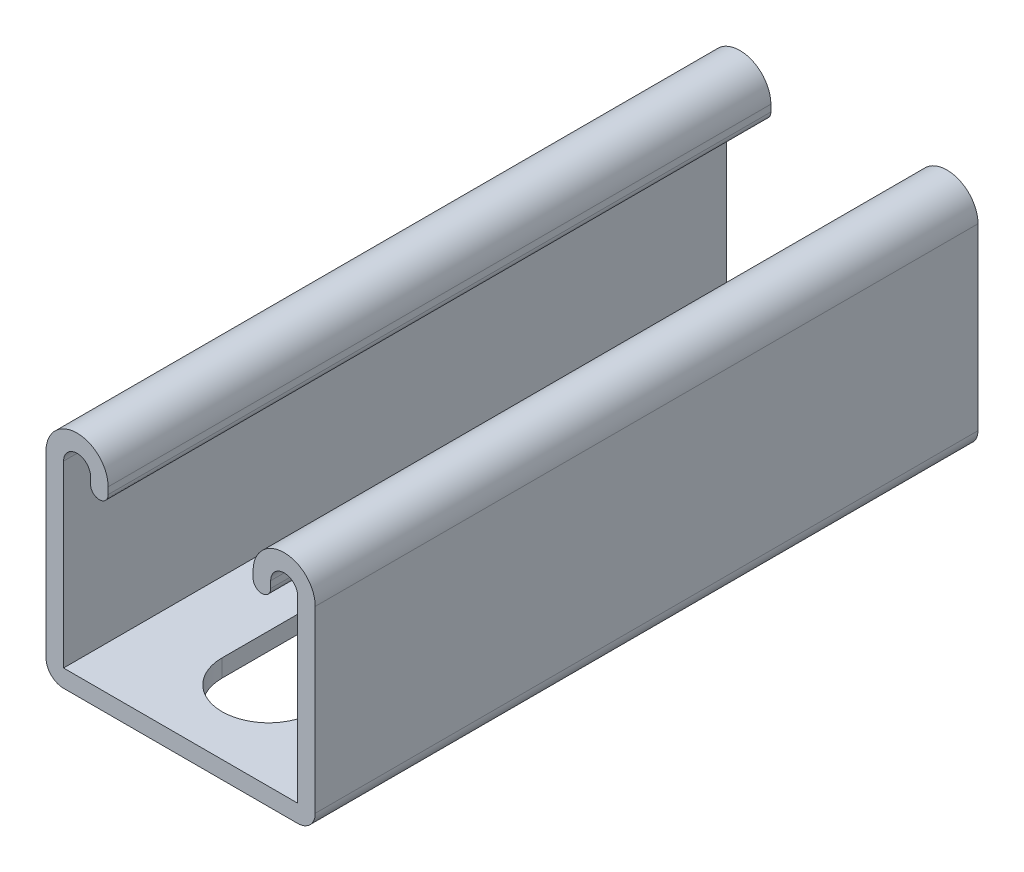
ISO-10303-21;
HEADER;
FILE_DESCRIPTION(('STEP AP214'),'2;1');
FILE_NAME('part.step','',(''),(''),'','','');
FILE_SCHEMA(('AUTOMOTIVE_DESIGN { 1 0 10303 214 1 1 1 1 }'));
ENDSEC;
DATA;
#1=APPLICATION_CONTEXT('core data for automotive mechanical design processes');
#2=APPLICATION_PROTOCOL_DEFINITION('international standard','automotive_design',2000,#1);
#3=PRODUCT_CONTEXT('',#1,'mechanical');
#4=PRODUCT('Part','Part','',(#3));
#5=PRODUCT_RELATED_PRODUCT_CATEGORY('part','',(#4));
#6=PRODUCT_DEFINITION_FORMATION('','',#4);
#7=PRODUCT_DEFINITION_CONTEXT('part definition',#1,'design');
#8=PRODUCT_DEFINITION('design','',#6,#7);
#9=PRODUCT_DEFINITION_SHAPE('','',#8);
#10=(LENGTH_UNIT() NAMED_UNIT(*) SI_UNIT(.MILLI.,.METRE.));
#11=(NAMED_UNIT(*) PLANE_ANGLE_UNIT() SI_UNIT($,.RADIAN.));
#12=(NAMED_UNIT(*) SI_UNIT($,.STERADIAN.) SOLID_ANGLE_UNIT());
#13=UNCERTAINTY_MEASURE_WITH_UNIT(LENGTH_MEASURE(1.E-05),#10,'distance_accuracy_value','');
#14=(GEOMETRIC_REPRESENTATION_CONTEXT(3) GLOBAL_UNCERTAINTY_ASSIGNED_CONTEXT((#13)) GLOBAL_UNIT_ASSIGNED_CONTEXT((#10,
#11,#12)) REPRESENTATION_CONTEXT('',''));
#15=CARTESIAN_POINT('',(0.,0.,0.));
#16=DIRECTION('',(0.,0.,1.));
#17=DIRECTION('',(1.,0.,0.));
#18=AXIS2_PLACEMENT_3D('',#15,#16,#17);
#19=CARTESIAN_POINT('',(-15.875,15.1511,101.6));
#20=DIRECTION('',(0.,0.,-1.));
#21=DIRECTION('',(-1.,0.,0.));
#22=AXIS2_PLACEMENT_3D('',#19,#20,#21);
#23=CYLINDRICAL_SURFACE('',#22,4.7625);
#24=CARTESIAN_POINT('',(-15.875,15.1511,0.));
#25=DIRECTION('',(0.,0.,1.));
#26=DIRECTION('',(-1.,0.,0.));
#27=AXIS2_PLACEMENT_3D('',#24,#25,#26);
#28=CIRCLE('',#27,4.7625);
#29=CARTESIAN_POINT('',(-11.1125,15.1511,0.));
#30=VERTEX_POINT('',#29);
#31=CARTESIAN_POINT('',(-20.6375,15.1511,0.));
#32=VERTEX_POINT('',#31);
#33=EDGE_CURVE('E254',#30,#32,#28,.T.);
#34=ORIENTED_EDGE('',*,*,#33,.T.);
#35=DIRECTION('',(0.,0.,-1.));
#36=VECTOR('',#35,1.);
#37=CARTESIAN_POINT('',(-20.6375,15.1511,101.6));
#38=LINE('',#37,#36);
#39=CARTESIAN_POINT('',(-20.6375,15.1511,101.6));
#40=VERTEX_POINT('',#39);
#41=EDGE_CURVE('E385',#40,#32,#38,.T.);
#42=ORIENTED_EDGE('',*,*,#41,.F.);
#43=CARTESIAN_POINT('',(-15.875,15.1511,101.6));
#44=DIRECTION('',(0.,0.,1.));
#45=DIRECTION('',(-1.,0.,0.));
#46=AXIS2_PLACEMENT_3D('',#43,#44,#45);
#47=CIRCLE('',#46,4.7625);
#48=CARTESIAN_POINT('',(-11.1125,15.1511,101.6));
#49=VERTEX_POINT('',#48);
#50=EDGE_CURVE('E261',#49,#40,#47,.T.);
#51=ORIENTED_EDGE('',*,*,#50,.F.);
#52=DIRECTION('',(0.,0.,-1.));
#53=VECTOR('',#52,1.);
#54=CARTESIAN_POINT('',(-11.1125,15.1511,101.6));
#55=LINE('',#54,#53);
#56=EDGE_CURVE('E299',#49,#30,#55,.T.);
#57=ORIENTED_EDGE('',*,*,#56,.T.);
#58=EDGE_LOOP('',(#34,#42,#51,#57));
#59=FACE_BOUND('',#58,.T.);
#60=ADVANCED_FACE('F33',(#59),#23,.T.);
#61=CARTESIAN_POINT('',(-20.6375,15.1511,101.6));
#62=DIRECTION('',(1.,0.,0.));
#63=DIRECTION('',(0.,1.,0.));
#64=AXIS2_PLACEMENT_3D('',#61,#62,#63);
#65=PLANE('',#64);
#66=DIRECTION('',(0.,-1.,0.));
#67=VECTOR('',#66,1.);
#68=CARTESIAN_POINT('',(-20.6375,15.1511,0.));
#69=LINE('',#68,#67);
#70=CARTESIAN_POINT('',(-20.6375,-12.319,0.));
#71=VERTEX_POINT('',#70);
#72=EDGE_CURVE('E302',#32,#71,#69,.T.);
#73=ORIENTED_EDGE('',*,*,#72,.T.);
#74=DIRECTION('',(0.,0.,-1.));
#75=VECTOR('',#74,1.);
#76=CARTESIAN_POINT('',(-20.6375,-12.319,101.6));
#77=LINE('',#76,#75);
#78=CARTESIAN_POINT('',(-20.6375,-12.319,101.6));
#79=VERTEX_POINT('',#78);
#80=EDGE_CURVE('E382',#79,#71,#77,.T.);
#81=ORIENTED_EDGE('',*,*,#80,.F.);
#82=DIRECTION('',(0.,-1.,0.));
#83=VECTOR('',#82,1.);
#84=CARTESIAN_POINT('',(-20.6375,15.1511,101.6));
#85=LINE('',#84,#83);
#86=EDGE_CURVE('E264',#40,#79,#85,.T.);
#87=ORIENTED_EDGE('',*,*,#86,.F.);
#88=ORIENTED_EDGE('',*,*,#41,.T.);
#89=EDGE_LOOP('',(#73,#81,#87,#88));
#90=FACE_BOUND('',#89,.T.);
#91=ADVANCED_FACE('F426',(#90),#65,.F.);
#92=CARTESIAN_POINT('',(-17.9451,-12.319,101.6));
#93=DIRECTION('',(0.,0.,-1.));
#94=DIRECTION('',(-1.,0.,0.));
#95=AXIS2_PLACEMENT_3D('',#92,#93,#94);
#96=CYLINDRICAL_SURFACE('',#95,2.6924);
#97=CARTESIAN_POINT('',(-17.9451,-12.319,0.));
#98=DIRECTION('',(0.,0.,1.));
#99=DIRECTION('',(-1.,0.,0.));
#100=AXIS2_PLACEMENT_3D('',#97,#98,#99);
#101=CIRCLE('',#100,2.6924);
#102=CARTESIAN_POINT('',(-17.9451,-15.0114,0.));
#103=VERTEX_POINT('',#102);
#104=EDGE_CURVE('E304',#71,#103,#101,.T.);
#105=ORIENTED_EDGE('',*,*,#104,.T.);
#106=DIRECTION('',(0.,0.,-1.));
#107=VECTOR('',#106,1.);
#108=CARTESIAN_POINT('',(-17.9451,-15.0114,101.6));
#109=LINE('',#108,#107);
#110=CARTESIAN_POINT('',(-17.9451,-15.0114,101.6));
#111=VERTEX_POINT('',#110);
#112=EDGE_CURVE('E379',#111,#103,#109,.T.);
#113=ORIENTED_EDGE('',*,*,#112,.F.);
#114=CARTESIAN_POINT('',(-17.9451,-12.319,101.6));
#115=DIRECTION('',(0.,0.,1.));
#116=DIRECTION('',(-1.,0.,0.));
#117=AXIS2_PLACEMENT_3D('',#114,#115,#116);
#118=CIRCLE('',#117,2.6924);
#119=EDGE_CURVE('E267',#79,#111,#118,.T.);
#120=ORIENTED_EDGE('',*,*,#119,.F.);
#121=ORIENTED_EDGE('',*,*,#80,.T.);
#122=EDGE_LOOP('',(#105,#113,#120,#121));
#123=FACE_BOUND('',#122,.T.);
#124=ADVANCED_FACE('F431',(#123),#96,.T.);
#125=CARTESIAN_POINT('',(-17.9451,-15.0114,101.6));
#126=DIRECTION('',(0.,1.,0.));
#127=DIRECTION('',(-1.,0.,0.));
#128=AXIS2_PLACEMENT_3D('',#125,#126,#127);
#129=PLANE('',#128);
#130=DIRECTION('',(0.,0.,-1.));
#131=VECTOR('',#130,1.);
#132=CARTESIAN_POINT('',(-7.14375,-15.0113999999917,73.81875));
#133=LINE('',#132,#131);
#134=CARTESIAN_POINT('',(-7.14375,-15.0114,88.10625));
#135=VERTEX_POINT('',#134);
#136=CARTESIAN_POINT('',(-7.14375,-15.0113999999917,73.81875));
#137=VERTEX_POINT('',#136);
#138=EDGE_CURVE('E207',#135,#137,#133,.T.);
#139=ORIENTED_EDGE('',*,*,#138,.F.);
#140=CARTESIAN_POINT('',(0.,-15.0113999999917,88.10625));
#141=DIRECTION('',(0.,-1.,0.));
#142=DIRECTION('',(1.,0.,0.));
#143=AXIS2_PLACEMENT_3D('',#140,#141,#142);
#144=CIRCLE('',#143,7.14375);
#145=CARTESIAN_POINT('',(7.14375,-15.0113999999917,88.10625));
#146=VERTEX_POINT('',#145);
#147=EDGE_CURVE('E47',#146,#135,#144,.T.);
#148=ORIENTED_EDGE('',*,*,#147,.F.);
#149=DIRECTION('',(0.,0.,1.));
#150=VECTOR('',#149,1.);
#151=CARTESIAN_POINT('',(7.14375,-15.0113999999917,88.10625));
#152=LINE('',#151,#150);
#153=CARTESIAN_POINT('',(7.14375,-15.0113999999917,73.81875));
#154=VERTEX_POINT('',#153);
#155=EDGE_CURVE('E223',#154,#146,#152,.T.);
#156=ORIENTED_EDGE('',*,*,#155,.F.);
#157=CARTESIAN_POINT('',(0.,-15.0113999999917,73.81875));
#158=DIRECTION('',(0.,-1.,0.));
#159=DIRECTION('',(1.,0.,0.));
#160=AXIS2_PLACEMENT_3D('',#157,#158,#159);
#161=CIRCLE('',#160,7.14375);
#162=EDGE_CURVE('E217',#137,#154,#161,.T.);
#163=ORIENTED_EDGE('',*,*,#162,.F.);
#164=EDGE_LOOP('',(#139,#148,#156,#163));
#165=FACE_BOUND('',#164,.T.);
#166=DIRECTION('',(0.,0.,-1.));
#167=VECTOR('',#166,1.);
#168=CARTESIAN_POINT('',(-7.14375,-15.0113999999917,23.01875));
#169=LINE('',#168,#167);
#170=CARTESIAN_POINT('',(-7.14375,-15.0114,37.30625));
#171=VERTEX_POINT('',#170);
#172=CARTESIAN_POINT('',(-7.14375,-15.0113999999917,23.01875));
#173=VERTEX_POINT('',#172);
#174=EDGE_CURVE('E242',#171,#173,#169,.T.);
#175=ORIENTED_EDGE('',*,*,#174,.F.);
#176=CARTESIAN_POINT('',(0.,-15.0113999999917,37.30625));
#177=DIRECTION('',(0.,-1.,0.));
#178=DIRECTION('',(1.,0.,0.));
#179=AXIS2_PLACEMENT_3D('',#176,#177,#178);
#180=CIRCLE('',#179,7.14375);
#181=CARTESIAN_POINT('',(7.14375,-15.0113999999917,37.30625));
#182=VERTEX_POINT('',#181);
#183=EDGE_CURVE('E240',#182,#171,#180,.T.);
#184=ORIENTED_EDGE('',*,*,#183,.F.);
#185=DIRECTION('',(0.,0.,1.));
#186=VECTOR('',#185,1.);
#187=CARTESIAN_POINT('',(7.14375,-15.0113999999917,37.30625));
#188=LINE('',#187,#186);
#189=CARTESIAN_POINT('',(7.14375,-15.0113999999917,23.01875));
#190=VERTEX_POINT('',#189);
#191=EDGE_CURVE('E248',#190,#182,#188,.T.);
#192=ORIENTED_EDGE('',*,*,#191,.F.);
#193=CARTESIAN_POINT('',(0.,-15.0113999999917,23.01875));
#194=DIRECTION('',(0.,-1.,0.));
#195=DIRECTION('',(1.,0.,0.));
#196=AXIS2_PLACEMENT_3D('',#193,#194,#195);
#197=CIRCLE('',#196,7.14375);
#198=EDGE_CURVE('E245',#173,#190,#197,.T.);
#199=ORIENTED_EDGE('',*,*,#198,.F.);
#200=EDGE_LOOP('',(#175,#184,#192,#199));
#201=FACE_BOUND('',#200,.T.);
#202=DIRECTION('',(1.,0.,0.));
#203=VECTOR('',#202,1.);
#204=CARTESIAN_POINT('',(-17.9451,-15.0114,0.));
#205=LINE('',#204,#203);
#206=CARTESIAN_POINT('',(17.9451,-15.0114,0.));
#207=VERTEX_POINT('',#206);
#208=EDGE_CURVE('E306',#103,#207,#205,.T.);
#209=ORIENTED_EDGE('',*,*,#208,.T.);
#210=DIRECTION('',(0.,0.,-1.));
#211=VECTOR('',#210,1.);
#212=CARTESIAN_POINT('',(17.9451,-15.0114,101.6));
#213=LINE('',#212,#211);
#214=CARTESIAN_POINT('',(17.9451,-15.0114,101.6));
#215=VERTEX_POINT('',#214);
#216=EDGE_CURVE('E376',#215,#207,#213,.T.);
#217=ORIENTED_EDGE('',*,*,#216,.F.);
#218=DIRECTION('',(1.,0.,0.));
#219=VECTOR('',#218,1.);
#220=CARTESIAN_POINT('',(-17.9451,-15.0114,101.6));
#221=LINE('',#220,#219);
#222=EDGE_CURVE('E269',#111,#215,#221,.T.);
#223=ORIENTED_EDGE('',*,*,#222,.F.);
#224=ORIENTED_EDGE('',*,*,#112,.T.);
#225=EDGE_LOOP('',(#209,#217,#223,#224));
#226=FACE_BOUND('',#225,.T.);
#227=ADVANCED_FACE('F221',(#165,#201,#226),#129,.F.);
#228=CARTESIAN_POINT('',(17.9451,-12.319,101.6));
#229=DIRECTION('',(0.,0.,-1.));
#230=DIRECTION('',(-1.,0.,0.));
#231=AXIS2_PLACEMENT_3D('',#228,#229,#230);
#232=CYLINDRICAL_SURFACE('',#231,2.6924);
#233=CARTESIAN_POINT('',(17.9451,-12.319,0.));
#234=DIRECTION('',(0.,0.,1.));
#235=DIRECTION('',(1.,0.,0.));
#236=AXIS2_PLACEMENT_3D('',#233,#234,#235);
#237=CIRCLE('',#236,2.6924);
#238=CARTESIAN_POINT('',(20.6375,-12.319,0.));
#239=VERTEX_POINT('',#238);
#240=EDGE_CURVE('E308',#207,#239,#237,.T.);
#241=ORIENTED_EDGE('',*,*,#240,.T.);
#242=DIRECTION('',(0.,0.,-1.));
#243=VECTOR('',#242,1.);
#244=CARTESIAN_POINT('',(20.6375,-12.319,101.6));
#245=LINE('',#244,#243);
#246=CARTESIAN_POINT('',(20.6375,-12.319,101.6));
#247=VERTEX_POINT('',#246);
#248=EDGE_CURVE('E373',#247,#239,#245,.T.);
#249=ORIENTED_EDGE('',*,*,#248,.F.);
#250=CARTESIAN_POINT('',(17.9451,-12.319,101.6));
#251=DIRECTION('',(0.,0.,1.));
#252=DIRECTION('',(1.,0.,0.));
#253=AXIS2_PLACEMENT_3D('',#250,#251,#252);
#254=CIRCLE('',#253,2.6924);
#255=EDGE_CURVE('E271',#215,#247,#254,.T.);
#256=ORIENTED_EDGE('',*,*,#255,.F.);
#257=ORIENTED_EDGE('',*,*,#216,.T.);
#258=EDGE_LOOP('',(#241,#249,#256,#257));
#259=FACE_BOUND('',#258,.T.);
#260=ADVANCED_FACE('F511',(#259),#232,.T.);
#261=CARTESIAN_POINT('',(20.6375,-12.319,101.6));
#262=DIRECTION('',(-1.,0.,0.));
#263=DIRECTION('',(0.,0.,1.));
#264=AXIS2_PLACEMENT_3D('',#261,#262,#263);
#265=PLANE('',#264);
#266=DIRECTION('',(0.,1.,0.));
#267=VECTOR('',#266,1.);
#268=CARTESIAN_POINT('',(20.6375,-12.319,0.));
#269=LINE('',#268,#267);
#270=CARTESIAN_POINT('',(20.6375,15.1511,0.));
#271=VERTEX_POINT('',#270);
#272=EDGE_CURVE('E310',#239,#271,#269,.T.);
#273=ORIENTED_EDGE('',*,*,#272,.T.);
#274=DIRECTION('',(0.,0.,-1.));
#275=VECTOR('',#274,1.);
#276=CARTESIAN_POINT('',(20.6375,15.1511,101.6));
#277=LINE('',#276,#275);
#278=CARTESIAN_POINT('',(20.6375,15.1511,101.6));
#279=VERTEX_POINT('',#278);
#280=EDGE_CURVE('E370',#279,#271,#277,.T.);
#281=ORIENTED_EDGE('',*,*,#280,.F.);
#282=DIRECTION('',(0.,1.,0.));
#283=VECTOR('',#282,1.);
#284=CARTESIAN_POINT('',(20.6375,-12.319,101.6));
#285=LINE('',#284,#283);
#286=EDGE_CURVE('E273',#247,#279,#285,.T.);
#287=ORIENTED_EDGE('',*,*,#286,.F.);
#288=ORIENTED_EDGE('',*,*,#248,.T.);
#289=EDGE_LOOP('',(#273,#281,#287,#288));
#290=FACE_BOUND('',#289,.T.);
#291=ADVANCED_FACE('F507',(#290),#265,.F.);
#292=CARTESIAN_POINT('',(15.875,15.1511,101.6));
#293=DIRECTION('',(0.,0.,-1.));
#294=DIRECTION('',(-1.,0.,0.));
#295=AXIS2_PLACEMENT_3D('',#292,#293,#294);
#296=CYLINDRICAL_SURFACE('',#295,4.7625);
#297=CARTESIAN_POINT('',(15.875,15.1511,0.));
#298=DIRECTION('',(0.,0.,1.));
#299=DIRECTION('',(1.,0.,0.));
#300=AXIS2_PLACEMENT_3D('',#297,#298,#299);
#301=CIRCLE('',#300,4.7625);
#302=CARTESIAN_POINT('',(11.1125,15.1511,0.));
#303=VERTEX_POINT('',#302);
#304=EDGE_CURVE('E312',#271,#303,#301,.T.);
#305=ORIENTED_EDGE('',*,*,#304,.T.);
#306=DIRECTION('',(0.,0.,-1.));
#307=VECTOR('',#306,1.);
#308=CARTESIAN_POINT('',(11.1125,15.1511,101.6));
#309=LINE('',#308,#307);
#310=CARTESIAN_POINT('',(11.1125,15.1511,101.6));
#311=VERTEX_POINT('',#310);
#312=EDGE_CURVE('E367',#311,#303,#309,.T.);
#313=ORIENTED_EDGE('',*,*,#312,.F.);
#314=CARTESIAN_POINT('',(15.875,15.1511,101.6));
#315=DIRECTION('',(0.,0.,1.));
#316=DIRECTION('',(1.,0.,0.));
#317=AXIS2_PLACEMENT_3D('',#314,#315,#316);
#318=CIRCLE('',#317,4.7625);
#319=EDGE_CURVE('E275',#279,#311,#318,.T.);
#320=ORIENTED_EDGE('',*,*,#319,.F.);
#321=ORIENTED_EDGE('',*,*,#280,.T.);
#322=EDGE_LOOP('',(#305,#313,#320,#321));
#323=FACE_BOUND('',#322,.T.);
#324=ADVANCED_FACE('F502',(#323),#296,.T.);
#325=CARTESIAN_POINT('',(11.1125,15.1511,101.6));
#326=DIRECTION('',(1.,0.,0.));
#327=DIRECTION('',(0.,1.,0.));
#328=AXIS2_PLACEMENT_3D('',#325,#326,#327);
#329=PLANE('',#328);
#330=DIRECTION('',(0.,-1.,0.));
#331=VECTOR('',#330,1.);
#332=CARTESIAN_POINT('',(11.1125,15.1511,0.));
#333=LINE('',#332,#331);
#334=CARTESIAN_POINT('',(11.1125,14.11605,0.));
#335=VERTEX_POINT('',#334);
#336=EDGE_CURVE('E314',#303,#335,#333,.T.);
#337=ORIENTED_EDGE('',*,*,#336,.T.);
#338=DIRECTION('',(0.,0.,-1.));
#339=VECTOR('',#338,1.);
#340=CARTESIAN_POINT('',(11.1125,14.11605,101.6));
#341=LINE('',#340,#339);
#342=CARTESIAN_POINT('',(11.1125,14.11605,101.6));
#343=VERTEX_POINT('',#342);
#344=EDGE_CURVE('E364',#343,#335,#341,.T.);
#345=ORIENTED_EDGE('',*,*,#344,.F.);
#346=DIRECTION('',(0.,-1.,0.));
#347=VECTOR('',#346,1.);
#348=CARTESIAN_POINT('',(11.1125,15.1511,101.6));
#349=LINE('',#348,#347);
#350=EDGE_CURVE('E277',#311,#343,#349,.T.);
#351=ORIENTED_EDGE('',*,*,#350,.F.);
#352=ORIENTED_EDGE('',*,*,#312,.T.);
#353=EDGE_LOOP('',(#337,#345,#351,#352));
#354=FACE_BOUND('',#353,.T.);
#355=ADVANCED_FACE('F496',(#354),#329,.F.);
#356=CARTESIAN_POINT('',(12.4587,14.11605,101.6));
#357=DIRECTION('',(0.,0.,-1.));
#358=DIRECTION('',(-1.,0.,0.));
#359=AXIS2_PLACEMENT_3D('',#356,#357,#358);
#360=CYLINDRICAL_SURFACE('',#359,1.3462);
#361=CARTESIAN_POINT('',(12.4587,14.11605,0.));
#362=DIRECTION('',(0.,0.,1.));
#363=DIRECTION('',(1.,0.,0.));
#364=AXIS2_PLACEMENT_3D('',#361,#362,#363);
#365=CIRCLE('',#364,1.3462);
#366=CARTESIAN_POINT('',(13.8049,14.11605,0.));
#367=VERTEX_POINT('',#366);
#368=EDGE_CURVE('E316',#335,#367,#365,.T.);
#369=ORIENTED_EDGE('',*,*,#368,.T.);
#370=DIRECTION('',(0.,0.,-1.));
#371=VECTOR('',#370,1.);
#372=CARTESIAN_POINT('',(13.8049,14.11605,101.6));
#373=LINE('',#372,#371);
#374=CARTESIAN_POINT('',(13.8049,14.11605,101.6));
#375=VERTEX_POINT('',#374);
#376=EDGE_CURVE('E361',#375,#367,#373,.T.);
#377=ORIENTED_EDGE('',*,*,#376,.F.);
#378=CARTESIAN_POINT('',(12.4587,14.11605,101.6));
#379=DIRECTION('',(0.,0.,1.));
#380=DIRECTION('',(1.,0.,0.));
#381=AXIS2_PLACEMENT_3D('',#378,#379,#380);
#382=CIRCLE('',#381,1.3462);
#383=EDGE_CURVE('E279',#343,#375,#382,.T.);
#384=ORIENTED_EDGE('',*,*,#383,.F.);
#385=ORIENTED_EDGE('',*,*,#344,.T.);
#386=EDGE_LOOP('',(#369,#377,#384,#385));
#387=FACE_BOUND('',#386,.T.);
#388=ADVANCED_FACE('F492',(#387),#360,.T.);
#389=CARTESIAN_POINT('',(13.8049,15.1511,101.6));
#390=DIRECTION('',(-1.,0.,0.));
#391=DIRECTION('',(0.,0.,1.));
#392=AXIS2_PLACEMENT_3D('',#389,#390,#391);
#393=PLANE('',#392);
#394=DIRECTION('',(0.,1.,0.));
#395=VECTOR('',#394,1.);
#396=CARTESIAN_POINT('',(13.8049,15.1511,0.));
#397=LINE('',#396,#395);
#398=CARTESIAN_POINT('',(13.8049,15.1511,0.));
#399=VERTEX_POINT('',#398);
#400=EDGE_CURVE('E318',#367,#399,#397,.T.);
#401=ORIENTED_EDGE('',*,*,#400,.T.);
#402=DIRECTION('',(0.,0.,-1.));
#403=VECTOR('',#402,1.);
#404=CARTESIAN_POINT('',(13.8049,15.1511,101.6));
#405=LINE('',#404,#403);
#406=CARTESIAN_POINT('',(13.8049,15.1511,101.6));
#407=VERTEX_POINT('',#406);
#408=EDGE_CURVE('E358',#407,#399,#405,.T.);
#409=ORIENTED_EDGE('',*,*,#408,.F.);
#410=DIRECTION('',(0.,1.,0.));
#411=VECTOR('',#410,1.);
#412=CARTESIAN_POINT('',(13.8049,15.1511,101.6));
#413=LINE('',#412,#411);
#414=EDGE_CURVE('E281',#375,#407,#413,.T.);
#415=ORIENTED_EDGE('',*,*,#414,.F.);
#416=ORIENTED_EDGE('',*,*,#376,.T.);
#417=EDGE_LOOP('',(#401,#409,#415,#416));
#418=FACE_BOUND('',#417,.T.);
#419=ADVANCED_FACE('F487',(#418),#393,.F.);
#420=CARTESIAN_POINT('',(15.875,15.1511,101.6));
#421=DIRECTION('',(0.,0.,-1.));
#422=DIRECTION('',(-1.,0.,0.));
#423=AXIS2_PLACEMENT_3D('',#420,#421,#422);
#424=CYLINDRICAL_SURFACE('',#423,2.0701);
#425=CARTESIAN_POINT('',(15.875,15.1511,0.));
#426=DIRECTION('',(0.,0.,-1.));
#427=DIRECTION('',(1.,0.,0.));
#428=AXIS2_PLACEMENT_3D('',#425,#426,#427);
#429=CIRCLE('',#428,2.0701);
#430=CARTESIAN_POINT('',(17.9451,15.1511,0.));
#431=VERTEX_POINT('',#430);
#432=EDGE_CURVE('E320',#399,#431,#429,.T.);
#433=ORIENTED_EDGE('',*,*,#432,.T.);
#434=DIRECTION('',(0.,0.,-1.));
#435=VECTOR('',#434,1.);
#436=CARTESIAN_POINT('',(17.9451,15.1511,101.6));
#437=LINE('',#436,#435);
#438=CARTESIAN_POINT('',(17.9451,15.1511,101.6));
#439=VERTEX_POINT('',#438);
#440=EDGE_CURVE('E355',#439,#431,#437,.T.);
#441=ORIENTED_EDGE('',*,*,#440,.F.);
#442=CARTESIAN_POINT('',(15.875,15.1511,101.6));
#443=DIRECTION('',(0.,0.,-1.));
#444=DIRECTION('',(1.,0.,0.));
#445=AXIS2_PLACEMENT_3D('',#442,#443,#444);
#446=CIRCLE('',#445,2.0701);
#447=EDGE_CURVE('E283',#407,#439,#446,.T.);
#448=ORIENTED_EDGE('',*,*,#447,.F.);
#449=ORIENTED_EDGE('',*,*,#408,.T.);
#450=EDGE_LOOP('',(#433,#441,#448,#449));
#451=FACE_BOUND('',#450,.T.);
#452=ADVANCED_FACE('F481',(#451),#424,.F.);
#453=CARTESIAN_POINT('',(17.9451,-12.319,101.6));
#454=DIRECTION('',(1.,0.,0.));
#455=DIRECTION('',(0.,1.,0.));
#456=AXIS2_PLACEMENT_3D('',#453,#454,#455);
#457=PLANE('',#456);
#458=DIRECTION('',(0.,-1.,0.));
#459=VECTOR('',#458,1.);
#460=CARTESIAN_POINT('',(17.9451,-12.319,0.));
#461=LINE('',#460,#459);
#462=CARTESIAN_POINT('',(17.9451,-12.319,0.));
#463=VERTEX_POINT('',#462);
#464=EDGE_CURVE('E322',#431,#463,#461,.T.);
#465=ORIENTED_EDGE('',*,*,#464,.T.);
#466=DIRECTION('',(0.,0.,-1.));
#467=VECTOR('',#466,1.);
#468=CARTESIAN_POINT('',(17.9451,-12.319,101.6));
#469=LINE('',#468,#467);
#470=CARTESIAN_POINT('',(17.9451,-12.319,101.6));
#471=VERTEX_POINT('',#470);
#472=EDGE_CURVE('E352',#471,#463,#469,.T.);
#473=ORIENTED_EDGE('',*,*,#472,.F.);
#474=DIRECTION('',(0.,-1.,0.));
#475=VECTOR('',#474,1.);
#476=CARTESIAN_POINT('',(17.9451,-12.319,101.6));
#477=LINE('',#476,#475);
#478=EDGE_CURVE('E285',#439,#471,#477,.T.);
#479=ORIENTED_EDGE('',*,*,#478,.F.);
#480=ORIENTED_EDGE('',*,*,#440,.T.);
#481=EDGE_LOOP('',(#465,#473,#479,#480));
#482=FACE_BOUND('',#481,.T.);
#483=ADVANCED_FACE('F477',(#482),#457,.F.);
#484=CARTESIAN_POINT('',(-17.9451,-12.319,101.6));
#485=DIRECTION('',(0.,-1.,0.));
#486=DIRECTION('',(0.,0.,-1.));
#487=AXIS2_PLACEMENT_3D('',#484,#485,#486);
#488=PLANE('',#487);
#489=DIRECTION('',(0.,0.,1.));
#490=VECTOR('',#489,1.);
#491=CARTESIAN_POINT('',(7.14374999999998,-12.319,152.4));
#492=LINE('',#491,#490);
#493=CARTESIAN_POINT('',(7.14375,-12.319,73.81875));
#494=VERTEX_POINT('',#493);
#495=CARTESIAN_POINT('',(7.14375,-12.319,88.10625));
#496=VERTEX_POINT('',#495);
#497=EDGE_CURVE('E233',#494,#496,#492,.T.);
#498=ORIENTED_EDGE('',*,*,#497,.T.);
#499=CARTESIAN_POINT('',(0.,-12.319,88.10625));
#500=DIRECTION('',(0.,-1.,0.));
#501=DIRECTION('',(0.,0.,-1.));
#502=AXIS2_PLACEMENT_3D('',#499,#500,#501);
#503=CIRCLE('',#502,7.14375);
#504=CARTESIAN_POINT('',(-7.14375,-12.319,88.10625));
#505=VERTEX_POINT('',#504);
#506=EDGE_CURVE('E237',#496,#505,#503,.T.);
#507=ORIENTED_EDGE('',*,*,#506,.T.);
#508=DIRECTION('',(0.,0.,-1.));
#509=VECTOR('',#508,1.);
#510=CARTESIAN_POINT('',(-7.14375,-12.319,152.4));
#511=LINE('',#510,#509);
#512=CARTESIAN_POINT('',(-7.14375,-12.319,73.81875));
#513=VERTEX_POINT('',#512);
#514=EDGE_CURVE('E214',#505,#513,#511,.T.);
#515=ORIENTED_EDGE('',*,*,#514,.T.);
#516=CARTESIAN_POINT('',(0.,-12.319,73.81875));
#517=DIRECTION('',(0.,-1.,0.));
#518=DIRECTION('',(0.,0.,-1.));
#519=AXIS2_PLACEMENT_3D('',#516,#517,#518);
#520=CIRCLE('',#519,7.14375);
#521=EDGE_CURVE('E55',#513,#494,#520,.T.);
#522=ORIENTED_EDGE('',*,*,#521,.T.);
#523=EDGE_LOOP('',(#498,#507,#515,#522));
#524=FACE_BOUND('',#523,.T.);
#525=DIRECTION('',(0.,0.,1.));
#526=VECTOR('',#525,1.);
#527=CARTESIAN_POINT('',(7.14374999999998,-12.319,101.6));
#528=LINE('',#527,#526);
#529=CARTESIAN_POINT('',(7.14375,-12.319,23.01875));
#530=VERTEX_POINT('',#529);
#531=CARTESIAN_POINT('',(7.14375,-12.319,37.30625));
#532=VERTEX_POINT('',#531);
#533=EDGE_CURVE('E40',#530,#532,#528,.T.);
#534=ORIENTED_EDGE('',*,*,#533,.T.);
#535=CARTESIAN_POINT('',(0.,-12.319,37.30625));
#536=DIRECTION('',(0.,-1.,0.));
#537=DIRECTION('',(0.,0.,-1.));
#538=AXIS2_PLACEMENT_3D('',#535,#536,#537);
#539=CIRCLE('',#538,7.14375);
#540=CARTESIAN_POINT('',(-7.14375,-12.319,37.30625));
#541=VERTEX_POINT('',#540);
#542=EDGE_CURVE('E11',#532,#541,#539,.T.);
#543=ORIENTED_EDGE('',*,*,#542,.T.);
#544=DIRECTION('',(0.,0.,-1.));
#545=VECTOR('',#544,1.);
#546=CARTESIAN_POINT('',(-7.14375,-12.319,101.6));
#547=LINE('',#546,#545);
#548=CARTESIAN_POINT('',(-7.14375,-12.319,23.01875));
#549=VERTEX_POINT('',#548);
#550=EDGE_CURVE('E388',#541,#549,#547,.T.);
#551=ORIENTED_EDGE('',*,*,#550,.T.);
#552=CARTESIAN_POINT('',(0.,-12.319,23.01875));
#553=DIRECTION('',(0.,-1.,0.));
#554=DIRECTION('',(0.,0.,-1.));
#555=AXIS2_PLACEMENT_3D('',#552,#553,#554);
#556=CIRCLE('',#555,7.14375);
#557=EDGE_CURVE('E391',#549,#530,#556,.T.);
#558=ORIENTED_EDGE('',*,*,#557,.T.);
#559=EDGE_LOOP('',(#534,#543,#551,#558));
#560=FACE_BOUND('',#559,.T.);
#561=DIRECTION('',(-1.,0.,0.));
#562=VECTOR('',#561,1.);
#563=CARTESIAN_POINT('',(-17.9451,-12.319,0.));
#564=LINE('',#563,#562);
#565=CARTESIAN_POINT('',(-17.9451,-12.319,0.));
#566=VERTEX_POINT('',#565);
#567=EDGE_CURVE('E324',#463,#566,#564,.T.);
#568=ORIENTED_EDGE('',*,*,#567,.T.);
#569=DIRECTION('',(0.,0.,-1.));
#570=VECTOR('',#569,1.);
#571=CARTESIAN_POINT('',(-17.9451,-12.319,101.6));
#572=LINE('',#571,#570);
#573=CARTESIAN_POINT('',(-17.9451,-12.319,101.6));
#574=VERTEX_POINT('',#573);
#575=EDGE_CURVE('E349',#574,#566,#572,.T.);
#576=ORIENTED_EDGE('',*,*,#575,.F.);
#577=DIRECTION('',(-1.,0.,0.));
#578=VECTOR('',#577,1.);
#579=CARTESIAN_POINT('',(-17.9451,-12.319,101.6));
#580=LINE('',#579,#578);
#581=EDGE_CURVE('E287',#471,#574,#580,.T.);
#582=ORIENTED_EDGE('',*,*,#581,.F.);
#583=ORIENTED_EDGE('',*,*,#472,.T.);
#584=EDGE_LOOP('',(#568,#576,#582,#583));
#585=FACE_BOUND('',#584,.T.);
#586=ADVANCED_FACE('F395',(#524,#560,#585),#488,.F.);
#587=CARTESIAN_POINT('',(-17.9451,15.1511,101.6));
#588=DIRECTION('',(-1.,0.,0.));
#589=DIRECTION('',(0.,0.,1.));
#590=AXIS2_PLACEMENT_3D('',#587,#588,#589);
#591=PLANE('',#590);
#592=DIRECTION('',(0.,1.,0.));
#593=VECTOR('',#592,1.);
#594=CARTESIAN_POINT('',(-17.9451,15.1511,0.));
#595=LINE('',#594,#593);
#596=CARTESIAN_POINT('',(-17.9451,15.1511,0.));
#597=VERTEX_POINT('',#596);
#598=EDGE_CURVE('E326',#566,#597,#595,.T.);
#599=ORIENTED_EDGE('',*,*,#598,.T.);
#600=DIRECTION('',(0.,0.,-1.));
#601=VECTOR('',#600,1.);
#602=CARTESIAN_POINT('',(-17.9451,15.1511,101.6));
#603=LINE('',#602,#601);
#604=CARTESIAN_POINT('',(-17.9451,15.1511,101.6));
#605=VERTEX_POINT('',#604);
#606=EDGE_CURVE('E346',#605,#597,#603,.T.);
#607=ORIENTED_EDGE('',*,*,#606,.F.);
#608=DIRECTION('',(0.,1.,0.));
#609=VECTOR('',#608,1.);
#610=CARTESIAN_POINT('',(-17.9451,15.1511,101.6));
#611=LINE('',#610,#609);
#612=EDGE_CURVE('E289',#574,#605,#611,.T.);
#613=ORIENTED_EDGE('',*,*,#612,.F.);
#614=ORIENTED_EDGE('',*,*,#575,.T.);
#615=EDGE_LOOP('',(#599,#607,#613,#614));
#616=FACE_BOUND('',#615,.T.);
#617=ADVANCED_FACE('F468',(#616),#591,.F.);
#618=CARTESIAN_POINT('',(-15.875,15.1511,101.6));
#619=DIRECTION('',(0.,0.,-1.));
#620=DIRECTION('',(-1.,0.,0.));
#621=AXIS2_PLACEMENT_3D('',#618,#619,#620);
#622=CYLINDRICAL_SURFACE('',#621,2.0701);
#623=CARTESIAN_POINT('',(-15.875,15.1511,0.));
#624=DIRECTION('',(0.,0.,-1.));
#625=DIRECTION('',(-1.,0.,0.));
#626=AXIS2_PLACEMENT_3D('',#623,#624,#625);
#627=CIRCLE('',#626,2.0701);
#628=CARTESIAN_POINT('',(-13.8049,15.1511,0.));
#629=VERTEX_POINT('',#628);
#630=EDGE_CURVE('E328',#597,#629,#627,.T.);
#631=ORIENTED_EDGE('',*,*,#630,.T.);
#632=DIRECTION('',(0.,0.,-1.));
#633=VECTOR('',#632,1.);
#634=CARTESIAN_POINT('',(-13.8049,15.1511,101.6));
#635=LINE('',#634,#633);
#636=CARTESIAN_POINT('',(-13.8049,15.1511,101.6));
#637=VERTEX_POINT('',#636);
#638=EDGE_CURVE('E343',#637,#629,#635,.T.);
#639=ORIENTED_EDGE('',*,*,#638,.F.);
#640=CARTESIAN_POINT('',(-15.875,15.1511,101.6));
#641=DIRECTION('',(0.,0.,-1.));
#642=DIRECTION('',(-1.,0.,0.));
#643=AXIS2_PLACEMENT_3D('',#640,#641,#642);
#644=CIRCLE('',#643,2.0701);
#645=EDGE_CURVE('E291',#605,#637,#644,.T.);
#646=ORIENTED_EDGE('',*,*,#645,.F.);
#647=ORIENTED_EDGE('',*,*,#606,.T.);
#648=EDGE_LOOP('',(#631,#639,#646,#647));
#649=FACE_BOUND('',#648,.T.);
#650=ADVANCED_FACE('F464',(#649),#622,.F.);
#651=CARTESIAN_POINT('',(-13.8049,15.1511,101.6));
#652=DIRECTION('',(1.,0.,0.));
#653=DIRECTION('',(0.,1.,0.));
#654=AXIS2_PLACEMENT_3D('',#651,#652,#653);
#655=PLANE('',#654);
#656=DIRECTION('',(0.,-1.,0.));
#657=VECTOR('',#656,1.);
#658=CARTESIAN_POINT('',(-13.8049,15.1511,0.));
#659=LINE('',#658,#657);
#660=CARTESIAN_POINT('',(-13.8049,14.11605,0.));
#661=VERTEX_POINT('',#660);
#662=EDGE_CURVE('E330',#629,#661,#659,.T.);
#663=ORIENTED_EDGE('',*,*,#662,.T.);
#664=DIRECTION('',(0.,0.,-1.));
#665=VECTOR('',#664,1.);
#666=CARTESIAN_POINT('',(-13.8049,14.11605,101.6));
#667=LINE('',#666,#665);
#668=CARTESIAN_POINT('',(-13.8049,14.11605,101.6));
#669=VERTEX_POINT('',#668);
#670=EDGE_CURVE('E340',#669,#661,#667,.T.);
#671=ORIENTED_EDGE('',*,*,#670,.F.);
#672=DIRECTION('',(0.,-1.,0.));
#673=VECTOR('',#672,1.);
#674=CARTESIAN_POINT('',(-13.8049,15.1511,101.6));
#675=LINE('',#674,#673);
#676=EDGE_CURVE('E293',#637,#669,#675,.T.);
#677=ORIENTED_EDGE('',*,*,#676,.F.);
#678=ORIENTED_EDGE('',*,*,#638,.T.);
#679=EDGE_LOOP('',(#663,#671,#677,#678));
#680=FACE_BOUND('',#679,.T.);
#681=ADVANCED_FACE('F459',(#680),#655,.F.);
#682=CARTESIAN_POINT('',(-12.4587,14.11605,101.6));
#683=DIRECTION('',(0.,0.,-1.));
#684=DIRECTION('',(-1.,0.,0.));
#685=AXIS2_PLACEMENT_3D('',#682,#683,#684);
#686=CYLINDRICAL_SURFACE('',#685,1.3462);
#687=CARTESIAN_POINT('',(-12.4587,14.11605,0.));
#688=DIRECTION('',(0.,0.,1.));
#689=DIRECTION('',(-1.,0.,0.));
#690=AXIS2_PLACEMENT_3D('',#687,#688,#689);
#691=CIRCLE('',#690,1.3462);
#692=CARTESIAN_POINT('',(-11.1125,14.11605,0.));
#693=VERTEX_POINT('',#692);
#694=EDGE_CURVE('E332',#661,#693,#691,.T.);
#695=ORIENTED_EDGE('',*,*,#694,.T.);
#696=DIRECTION('',(0.,0.,-1.));
#697=VECTOR('',#696,1.);
#698=CARTESIAN_POINT('',(-11.1125,14.11605,101.6));
#699=LINE('',#698,#697);
#700=CARTESIAN_POINT('',(-11.1125,14.11605,101.6));
#701=VERTEX_POINT('',#700);
#702=EDGE_CURVE('E337',#701,#693,#699,.T.);
#703=ORIENTED_EDGE('',*,*,#702,.F.);
#704=CARTESIAN_POINT('',(-12.4587,14.11605,101.6));
#705=DIRECTION('',(0.,0.,1.));
#706=DIRECTION('',(-1.,0.,0.));
#707=AXIS2_PLACEMENT_3D('',#704,#705,#706);
#708=CIRCLE('',#707,1.3462);
#709=EDGE_CURVE('E295',#669,#701,#708,.T.);
#710=ORIENTED_EDGE('',*,*,#709,.F.);
#711=ORIENTED_EDGE('',*,*,#670,.T.);
#712=EDGE_LOOP('',(#695,#703,#710,#711));
#713=FACE_BOUND('',#712,.T.);
#714=ADVANCED_FACE('F453',(#713),#686,.T.);
#715=CARTESIAN_POINT('',(-11.1125,15.1511,101.6));
#716=DIRECTION('',(-1.,0.,0.));
#717=DIRECTION('',(0.,0.,1.));
#718=AXIS2_PLACEMENT_3D('',#715,#716,#717);
#719=PLANE('',#718);
#720=DIRECTION('',(0.,1.,0.));
#721=VECTOR('',#720,1.);
#722=CARTESIAN_POINT('',(-11.1125,15.1511,0.));
#723=LINE('',#722,#721);
#724=EDGE_CURVE('E265',#693,#30,#723,.T.);
#725=ORIENTED_EDGE('',*,*,#724,.T.);
#726=ORIENTED_EDGE('',*,*,#56,.F.);
#727=DIRECTION('',(0.,1.,0.));
#728=VECTOR('',#727,1.);
#729=CARTESIAN_POINT('',(-11.1125,15.1511,101.6));
#730=LINE('',#729,#728);
#731=EDGE_CURVE('E297',#701,#49,#730,.T.);
#732=ORIENTED_EDGE('',*,*,#731,.F.);
#733=ORIENTED_EDGE('',*,*,#702,.T.);
#734=EDGE_LOOP('',(#725,#726,#732,#733));
#735=FACE_BOUND('',#734,.T.);
#736=ADVANCED_FACE('F451',(#735),#719,.F.);
#737=CARTESIAN_POINT('',(-15.875,15.1511,101.6));
#738=DIRECTION('',(0.,0.,-1.));
#739=DIRECTION('',(-1.,0.,0.));
#740=AXIS2_PLACEMENT_3D('',#737,#738,#739);
#741=PLANE('',#740);
#742=ORIENTED_EDGE('',*,*,#50,.T.);
#743=ORIENTED_EDGE('',*,*,#86,.T.);
#744=ORIENTED_EDGE('',*,*,#119,.T.);
#745=ORIENTED_EDGE('',*,*,#222,.T.);
#746=ORIENTED_EDGE('',*,*,#255,.T.);
#747=ORIENTED_EDGE('',*,*,#286,.T.);
#748=ORIENTED_EDGE('',*,*,#319,.T.);
#749=ORIENTED_EDGE('',*,*,#350,.T.);
#750=ORIENTED_EDGE('',*,*,#383,.T.);
#751=ORIENTED_EDGE('',*,*,#414,.T.);
#752=ORIENTED_EDGE('',*,*,#447,.T.);
#753=ORIENTED_EDGE('',*,*,#478,.T.);
#754=ORIENTED_EDGE('',*,*,#581,.T.);
#755=ORIENTED_EDGE('',*,*,#612,.T.);
#756=ORIENTED_EDGE('',*,*,#645,.T.);
#757=ORIENTED_EDGE('',*,*,#676,.T.);
#758=ORIENTED_EDGE('',*,*,#709,.T.);
#759=ORIENTED_EDGE('',*,*,#731,.T.);
#760=EDGE_LOOP('',(#742,#743,#744,#745,#746,#747,#748,#749,#750,#751,#752,#753,#754,#755,#756,
#757,#758,#759));
#761=FACE_BOUND('',#760,.T.);
#762=ADVANCED_FACE('F446',(#761),#741,.F.);
#763=CARTESIAN_POINT('',(-15.875,15.1511,0.));
#764=DIRECTION('',(0.,0.,-1.));
#765=DIRECTION('',(-1.,0.,0.));
#766=AXIS2_PLACEMENT_3D('',#763,#764,#765);
#767=PLANE('',#766);
#768=ORIENTED_EDGE('',*,*,#33,.F.);
#769=ORIENTED_EDGE('',*,*,#724,.F.);
#770=ORIENTED_EDGE('',*,*,#694,.F.);
#771=ORIENTED_EDGE('',*,*,#662,.F.);
#772=ORIENTED_EDGE('',*,*,#630,.F.);
#773=ORIENTED_EDGE('',*,*,#598,.F.);
#774=ORIENTED_EDGE('',*,*,#567,.F.);
#775=ORIENTED_EDGE('',*,*,#464,.F.);
#776=ORIENTED_EDGE('',*,*,#432,.F.);
#777=ORIENTED_EDGE('',*,*,#400,.F.);
#778=ORIENTED_EDGE('',*,*,#368,.F.);
#779=ORIENTED_EDGE('',*,*,#336,.F.);
#780=ORIENTED_EDGE('',*,*,#304,.F.);
#781=ORIENTED_EDGE('',*,*,#272,.F.);
#782=ORIENTED_EDGE('',*,*,#240,.F.);
#783=ORIENTED_EDGE('',*,*,#208,.F.);
#784=ORIENTED_EDGE('',*,*,#104,.F.);
#785=ORIENTED_EDGE('',*,*,#72,.F.);
#786=EDGE_LOOP('',(#768,#769,#770,#771,#772,#773,#774,#775,#776,#777,#778,#779,#780,#781,#782,
#783,#784,#785));
#787=FACE_BOUND('',#786,.T.);
#788=ADVANCED_FACE('F439',(#787),#767,.T.);
#789=CARTESIAN_POINT('',(0.,19.9136,37.30625));
#790=DIRECTION('',(0.,-1.,0.));
#791=DIRECTION('',(1.,0.,0.));
#792=AXIS2_PLACEMENT_3D('',#789,#790,#791);
#793=CYLINDRICAL_SURFACE('',#792,7.14375);
#794=DIRECTION('',(0.,-1.,0.));
#795=VECTOR('',#794,1.);
#796=CARTESIAN_POINT('',(7.14375,19.9136,37.30625));
#797=LINE('',#796,#795);
#798=EDGE_CURVE('E252',#532,#182,#797,.T.);
#799=ORIENTED_EDGE('',*,*,#798,.T.);
#800=ORIENTED_EDGE('',*,*,#183,.T.);
#801=DIRECTION('',(0.,-1.,0.));
#802=VECTOR('',#801,1.);
#803=CARTESIAN_POINT('',(-7.14375,19.9136,37.30625));
#804=LINE('',#803,#802);
#805=EDGE_CURVE('E251',#541,#171,#804,.T.);
#806=ORIENTED_EDGE('',*,*,#805,.F.);
#807=ORIENTED_EDGE('',*,*,#542,.F.);
#808=EDGE_LOOP('',(#799,#800,#806,#807));
#809=FACE_BOUND('',#808,.T.);
#810=ADVANCED_FACE('F411',(#809),#793,.F.);
#811=CARTESIAN_POINT('',(7.14375,19.9136,37.30625));
#812=DIRECTION('',(1.,0.,0.));
#813=DIRECTION('',(0.,0.,-1.));
#814=AXIS2_PLACEMENT_3D('',#811,#812,#813);
#815=PLANE('',#814);
#816=DIRECTION('',(0.,-1.,0.));
#817=VECTOR('',#816,1.);
#818=CARTESIAN_POINT('',(7.14375,19.9136,23.01875));
#819=LINE('',#818,#817);
#820=EDGE_CURVE('E255',#530,#190,#819,.T.);
#821=ORIENTED_EDGE('',*,*,#820,.T.);
#822=ORIENTED_EDGE('',*,*,#191,.T.);
#823=ORIENTED_EDGE('',*,*,#798,.F.);
#824=ORIENTED_EDGE('',*,*,#533,.F.);
#825=EDGE_LOOP('',(#821,#822,#823,#824));
#826=FACE_BOUND('',#825,.T.);
#827=ADVANCED_FACE('F401',(#826),#815,.F.);
#828=CARTESIAN_POINT('',(0.,19.9136,23.01875));
#829=DIRECTION('',(0.,-1.,0.));
#830=DIRECTION('',(1.,0.,0.));
#831=AXIS2_PLACEMENT_3D('',#828,#829,#830);
#832=CYLINDRICAL_SURFACE('',#831,7.14375);
#833=DIRECTION('',(0.,-1.,0.));
#834=VECTOR('',#833,1.);
#835=CARTESIAN_POINT('',(-7.14375,19.9136,23.01875));
#836=LINE('',#835,#834);
#837=EDGE_CURVE('E257',#549,#173,#836,.T.);
#838=ORIENTED_EDGE('',*,*,#837,.T.);
#839=ORIENTED_EDGE('',*,*,#198,.T.);
#840=ORIENTED_EDGE('',*,*,#820,.F.);
#841=ORIENTED_EDGE('',*,*,#557,.F.);
#842=EDGE_LOOP('',(#838,#839,#840,#841));
#843=FACE_BOUND('',#842,.T.);
#844=ADVANCED_FACE('F403',(#843),#832,.F.);
#845=CARTESIAN_POINT('',(-7.14375,19.9136,23.01875));
#846=DIRECTION('',(-1.,0.,0.));
#847=DIRECTION('',(0.,-1.,0.));
#848=AXIS2_PLACEMENT_3D('',#845,#846,#847);
#849=PLANE('',#848);
#850=ORIENTED_EDGE('',*,*,#805,.T.);
#851=ORIENTED_EDGE('',*,*,#174,.T.);
#852=ORIENTED_EDGE('',*,*,#837,.F.);
#853=ORIENTED_EDGE('',*,*,#550,.F.);
#854=EDGE_LOOP('',(#850,#851,#852,#853));
#855=FACE_BOUND('',#854,.T.);
#856=ADVANCED_FACE('F413',(#855),#849,.F.);
#857=CARTESIAN_POINT('',(0.,19.9136,88.10625));
#858=DIRECTION('',(0.,-1.,0.));
#859=DIRECTION('',(1.,0.,0.));
#860=AXIS2_PLACEMENT_3D('',#857,#858,#859);
#861=CYLINDRICAL_SURFACE('',#860,7.14375);
#862=DIRECTION('',(0.,-1.,0.));
#863=VECTOR('',#862,1.);
#864=CARTESIAN_POINT('',(7.14375,19.9136,88.10625));
#865=LINE('',#864,#863);
#866=EDGE_CURVE('E231',#496,#146,#865,.T.);
#867=ORIENTED_EDGE('',*,*,#866,.T.);
#868=ORIENTED_EDGE('',*,*,#147,.T.);
#869=DIRECTION('',(0.,-1.,0.));
#870=VECTOR('',#869,1.);
#871=CARTESIAN_POINT('',(-7.14375,19.9136,88.10625));
#872=LINE('',#871,#870);
#873=EDGE_CURVE('E211',#505,#135,#872,.T.);
#874=ORIENTED_EDGE('',*,*,#873,.F.);
#875=ORIENTED_EDGE('',*,*,#506,.F.);
#876=EDGE_LOOP('',(#867,#868,#874,#875));
#877=FACE_BOUND('',#876,.T.);
#878=ADVANCED_FACE('F415',(#877),#861,.F.);
#879=CARTESIAN_POINT('',(7.14375,19.9136,88.10625));
#880=DIRECTION('',(1.,0.,0.));
#881=DIRECTION('',(0.,0.,-1.));
#882=AXIS2_PLACEMENT_3D('',#879,#880,#881);
#883=PLANE('',#882);
#884=DIRECTION('',(0.,-1.,0.));
#885=VECTOR('',#884,1.);
#886=CARTESIAN_POINT('',(7.14375,19.9136,73.81875));
#887=LINE('',#886,#885);
#888=EDGE_CURVE('E224',#494,#154,#887,.T.);
#889=ORIENTED_EDGE('',*,*,#888,.T.);
#890=ORIENTED_EDGE('',*,*,#155,.T.);
#891=ORIENTED_EDGE('',*,*,#866,.F.);
#892=ORIENTED_EDGE('',*,*,#497,.F.);
#893=EDGE_LOOP('',(#889,#890,#891,#892));
#894=FACE_BOUND('',#893,.T.);
#895=ADVANCED_FACE('F421',(#894),#883,.F.);
#896=CARTESIAN_POINT('',(0.,19.9136,73.81875));
#897=DIRECTION('',(0.,-1.,0.));
#898=DIRECTION('',(1.,0.,0.));
#899=AXIS2_PLACEMENT_3D('',#896,#897,#898);
#900=CYLINDRICAL_SURFACE('',#899,7.14375);
#901=DIRECTION('',(0.,-1.,0.));
#902=VECTOR('',#901,1.);
#903=CARTESIAN_POINT('',(-7.14375,19.9136,73.81875));
#904=LINE('',#903,#902);
#905=EDGE_CURVE('E209',#513,#137,#904,.T.);
#906=ORIENTED_EDGE('',*,*,#905,.T.);
#907=ORIENTED_EDGE('',*,*,#162,.T.);
#908=ORIENTED_EDGE('',*,*,#888,.F.);
#909=ORIENTED_EDGE('',*,*,#521,.F.);
#910=EDGE_LOOP('',(#906,#907,#908,#909));
#911=FACE_BOUND('',#910,.T.);
#912=ADVANCED_FACE('F216',(#911),#900,.F.);
#913=CARTESIAN_POINT('',(-7.14375,19.9136,73.81875));
#914=DIRECTION('',(-1.,0.,0.));
#915=DIRECTION('',(0.,-1.,0.));
#916=AXIS2_PLACEMENT_3D('',#913,#914,#915);
#917=PLANE('',#916);
#918=ORIENTED_EDGE('',*,*,#873,.T.);
#919=ORIENTED_EDGE('',*,*,#138,.T.);
#920=ORIENTED_EDGE('',*,*,#905,.F.);
#921=ORIENTED_EDGE('',*,*,#514,.F.);
#922=EDGE_LOOP('',(#918,#919,#920,#921));
#923=FACE_BOUND('',#922,.T.);
#924=ADVANCED_FACE('F208',(#923),#917,.F.);
#925=CLOSED_SHELL('',(#60,#91,#124,#227,#260,#291,#324,#355,#388,#419,#452,#483,#586,#617,#650,
#681,#714,#736,#762,#788,#810,#827,#844,#856,#878,#895,#912,#924));
#926=MANIFOLD_SOLID_BREP('B2',#925);
#927=ADVANCED_BREP_SHAPE_REPRESENTATION('',(#18,#926),#14);
#928=SHAPE_DEFINITION_REPRESENTATION(#9,#927);
ENDSEC;
END-ISO-10303-21;
